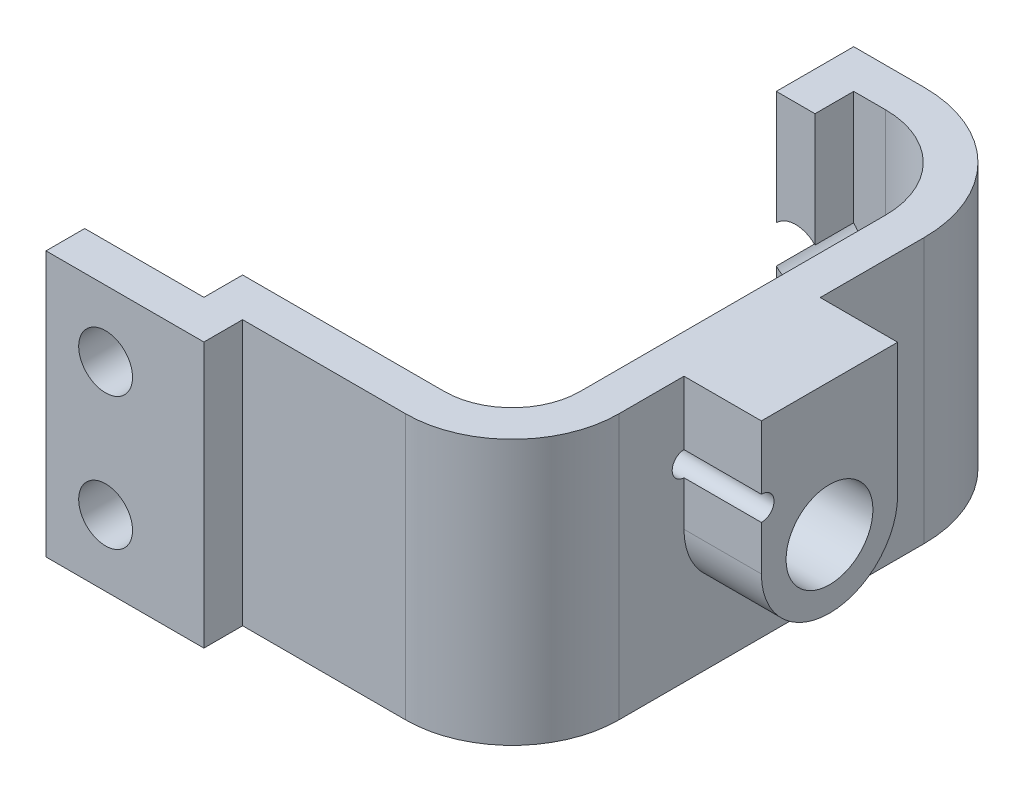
ISO-10303-21;
HEADER;
FILE_DESCRIPTION(('STEP AP214'),'2;1');
FILE_NAME('part.step','',(''),(''),'','','');
FILE_SCHEMA(('AUTOMOTIVE_DESIGN { 1 0 10303 214 1 1 1 1 }'));
ENDSEC;
DATA;
#1=APPLICATION_CONTEXT('core data for automotive mechanical design processes');
#2=APPLICATION_PROTOCOL_DEFINITION('international standard','automotive_design',2000,#1);
#3=PRODUCT_CONTEXT('',#1,'mechanical');
#4=PRODUCT('Part','Part','',(#3));
#5=PRODUCT_RELATED_PRODUCT_CATEGORY('part','',(#4));
#6=PRODUCT_DEFINITION_FORMATION('','',#4);
#7=PRODUCT_DEFINITION_CONTEXT('part definition',#1,'design');
#8=PRODUCT_DEFINITION('design','',#6,#7);
#9=PRODUCT_DEFINITION_SHAPE('','',#8);
#10=(LENGTH_UNIT() NAMED_UNIT(*) SI_UNIT(.MILLI.,.METRE.));
#11=(NAMED_UNIT(*) PLANE_ANGLE_UNIT() SI_UNIT($,.RADIAN.));
#12=(NAMED_UNIT(*) SI_UNIT($,.STERADIAN.) SOLID_ANGLE_UNIT());
#13=UNCERTAINTY_MEASURE_WITH_UNIT(LENGTH_MEASURE(1.E-05),#10,'distance_accuracy_value','');
#14=(GEOMETRIC_REPRESENTATION_CONTEXT(3) GLOBAL_UNCERTAINTY_ASSIGNED_CONTEXT((#13)) GLOBAL_UNIT_ASSIGNED_CONTEXT((#10,
#11,#12)) REPRESENTATION_CONTEXT('',''));
#15=CARTESIAN_POINT('',(0.,0.,0.));
#16=DIRECTION('',(0.,0.,1.));
#17=DIRECTION('',(1.,0.,0.));
#18=AXIS2_PLACEMENT_3D('',#15,#16,#17);
#19=CARTESIAN_POINT('',(15.4504200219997,21.75,-44.461807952));
#20=DIRECTION('',(1.,0.,0.));
#21=DIRECTION('',(0.,0.,-1.));
#22=AXIS2_PLACEMENT_3D('',#19,#20,#21);
#23=PLANE('',#22);
#24=DIRECTION('',(0.,-1.,0.));
#25=VECTOR('',#24,1.);
#26=CARTESIAN_POINT('',(15.4504200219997,21.75,-44.461807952));
#27=LINE('',#26,#25);
#28=CARTESIAN_POINT('',(15.4504200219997,21.75,-44.461807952));
#29=VERTEX_POINT('',#28);
#30=CARTESIAN_POINT('',(15.4504200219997,12.4122247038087,-44.4618079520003));
#31=VERTEX_POINT('',#30);
#32=EDGE_CURVE('E236',#29,#31,#27,.T.);
#33=ORIENTED_EDGE('',*,*,#32,.T.);
#34=DIRECTION('',(0.,0.,1.));
#35=VECTOR('',#34,1.);
#36=CARTESIAN_POINT('',(15.4504200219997,12.4122247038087,-44.4618079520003));
#37=LINE('',#36,#35);
#38=CARTESIAN_POINT('',(15.4504200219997,12.4122247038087,-38.111807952));
#39=VERTEX_POINT('',#38);
#40=EDGE_CURVE('E218',#31,#39,#37,.T.);
#41=ORIENTED_EDGE('',*,*,#40,.T.);
#42=DIRECTION('',(0.,-1.,0.));
#43=VECTOR('',#42,1.);
#44=CARTESIAN_POINT('',(15.4504200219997,21.75,-38.111807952));
#45=LINE('',#44,#43);
#46=CARTESIAN_POINT('',(15.4504200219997,21.75,-38.111807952));
#47=VERTEX_POINT('',#46);
#48=EDGE_CURVE('E247',#47,#39,#45,.T.);
#49=ORIENTED_EDGE('',*,*,#48,.F.);
#50=DIRECTION('',(0.,0.,1.));
#51=VECTOR('',#50,1.);
#52=CARTESIAN_POINT('',(15.4504200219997,21.75,-44.461807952));
#53=LINE('',#52,#51);
#54=EDGE_CURVE('E241',#29,#47,#53,.T.);
#55=ORIENTED_EDGE('',*,*,#54,.F.);
#56=EDGE_LOOP('',(#33,#41,#49,#55));
#57=FACE_BOUND('',#56,.T.);
#58=ADVANCED_FACE('F34',(#57),#23,.F.);
#59=CARTESIAN_POINT('',(15.4504200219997,21.75,-38.111807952));
#60=DIRECTION('',(0.,0.,-1.));
#61=DIRECTION('',(-1.,0.,0.));
#62=AXIS2_PLACEMENT_3D('',#59,#60,#61);
#63=PLANE('',#62);
#64=ORIENTED_EDGE('',*,*,#48,.T.);
#65=CARTESIAN_POINT('',(17.0379200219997,10.875,-38.111807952));
#66=DIRECTION('',(0.,0.,1.));
#67=DIRECTION('',(1.,0.,0.));
#68=AXIS2_PLACEMENT_3D('',#65,#66,#67);
#69=CIRCLE('',#68,2.2098);
#70=CARTESIAN_POINT('',(18.6254200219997,12.4122247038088,-38.111807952));
#71=VERTEX_POINT('',#70);
#72=EDGE_CURVE('E224',#71,#39,#69,.T.);
#73=ORIENTED_EDGE('',*,*,#72,.F.);
#74=DIRECTION('',(0.,-1.,0.));
#75=VECTOR('',#74,1.);
#76=CARTESIAN_POINT('',(18.6254200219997,21.75,-38.111807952));
#77=LINE('',#76,#75);
#78=CARTESIAN_POINT('',(18.6254200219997,21.75,-38.111807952));
#79=VERTEX_POINT('',#78);
#80=EDGE_CURVE('E354',#79,#71,#77,.T.);
#81=ORIENTED_EDGE('',*,*,#80,.F.);
#82=DIRECTION('',(1.,0.,0.));
#83=VECTOR('',#82,1.);
#84=CARTESIAN_POINT('',(15.4504200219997,21.75,-38.111807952));
#85=LINE('',#84,#83);
#86=EDGE_CURVE('E449',#47,#79,#85,.T.);
#87=ORIENTED_EDGE('',*,*,#86,.F.);
#88=EDGE_LOOP('',(#64,#73,#81,#87));
#89=FACE_BOUND('',#88,.T.);
#90=ADVANCED_FACE('F500',(#89),#63,.F.);
#91=CARTESIAN_POINT('',(18.6254200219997,21.75,-41.286807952));
#92=DIRECTION('',(1.,0.,0.));
#93=DIRECTION('',(0.,0.,-1.));
#94=AXIS2_PLACEMENT_3D('',#91,#92,#93);
#95=PLANE('',#94);
#96=DIRECTION('',(0.,0.,1.));
#97=VECTOR('',#96,1.);
#98=CARTESIAN_POINT('',(18.6254200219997,12.4122247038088,-44.4618079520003));
#99=LINE('',#98,#97);
#100=CARTESIAN_POINT('',(18.6254200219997,12.4122247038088,-41.286807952));
#101=VERTEX_POINT('',#100);
#102=EDGE_CURVE('E380',#101,#71,#99,.T.);
#103=ORIENTED_EDGE('',*,*,#102,.F.);
#104=DIRECTION('',(0.,-1.,0.));
#105=VECTOR('',#104,1.);
#106=CARTESIAN_POINT('',(18.6254200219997,21.75,-41.286807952));
#107=LINE('',#106,#105);
#108=CARTESIAN_POINT('',(18.6254200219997,21.75,-41.286807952));
#109=VERTEX_POINT('',#108);
#110=EDGE_CURVE('E351',#109,#101,#107,.T.);
#111=ORIENTED_EDGE('',*,*,#110,.F.);
#112=DIRECTION('',(0.,0.,1.));
#113=VECTOR('',#112,1.);
#114=CARTESIAN_POINT('',(18.6254200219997,21.75,-41.286807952));
#115=LINE('',#114,#113);
#116=EDGE_CURVE('E451',#109,#79,#115,.T.);
#117=ORIENTED_EDGE('',*,*,#116,.T.);
#118=ORIENTED_EDGE('',*,*,#80,.T.);
#119=EDGE_LOOP('',(#103,#111,#117,#118));
#120=FACE_BOUND('',#119,.T.);
#121=ADVANCED_FACE('F381',(#120),#95,.T.);
#122=CARTESIAN_POINT('',(-3.175,21.75,3.17500000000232));
#123=DIRECTION('',(0.,0.,-1.));
#124=DIRECTION('',(-1.,0.,0.));
#125=AXIS2_PLACEMENT_3D('',#122,#123,#124);
#126=PLANE('',#125);
#127=CARTESIAN_POINT('',(1.7145,16.3125,3.17500000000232));
#128=DIRECTION('',(0.,0.,-1.));
#129=DIRECTION('',(-1.,0.,0.));
#130=AXIS2_PLACEMENT_3D('',#127,#128,#129);
#131=CIRCLE('',#130,2.2098);
#132=CARTESIAN_POINT('',(-0.4953,16.3125,3.17500000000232));
#133=VERTEX_POINT('',#132);
#134=EDGE_CURVE('E507',#133,#133,#131,.T.);
#135=ORIENTED_EDGE('',*,*,#134,.T.);
#136=EDGE_LOOP('',(#135));
#137=FACE_BOUND('',#136,.T.);
#138=CARTESIAN_POINT('',(1.7145,5.4375,3.17500000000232));
#139=DIRECTION('',(0.,0.,-1.));
#140=DIRECTION('',(-1.,0.,0.));
#141=AXIS2_PLACEMENT_3D('',#138,#139,#140);
#142=CIRCLE('',#141,2.2098);
#143=CARTESIAN_POINT('',(-0.4953,5.4375,3.17500000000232));
#144=VERTEX_POINT('',#143);
#145=EDGE_CURVE('E502',#144,#144,#142,.T.);
#146=ORIENTED_EDGE('',*,*,#145,.T.);
#147=EDGE_LOOP('',(#146));
#148=FACE_BOUND('',#147,.T.);
#149=DIRECTION('',(1.,0.,0.));
#150=VECTOR('',#149,1.);
#151=CARTESIAN_POINT('',(-3.175,0.,3.17500000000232));
#152=LINE('',#151,#150);
#153=CARTESIAN_POINT('',(-3.175,0.,3.17500000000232));
#154=VERTEX_POINT('',#153);
#155=CARTESIAN_POINT('',(9.779,0.,3.17500000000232));
#156=VERTEX_POINT('',#155);
#157=EDGE_CURVE('E274',#154,#156,#152,.T.);
#158=ORIENTED_EDGE('',*,*,#157,.T.);
#159=DIRECTION('',(0.,-1.,0.));
#160=VECTOR('',#159,1.);
#161=CARTESIAN_POINT('',(9.779,21.75,3.17500000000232));
#162=LINE('',#161,#160);
#163=CARTESIAN_POINT('',(9.779,21.75,3.17500000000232));
#164=VERTEX_POINT('',#163);
#165=EDGE_CURVE('E42',#164,#156,#162,.T.);
#166=ORIENTED_EDGE('',*,*,#165,.F.);
#167=DIRECTION('',(1.,0.,0.));
#168=VECTOR('',#167,1.);
#169=CARTESIAN_POINT('',(-3.175,21.75,3.17500000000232));
#170=LINE('',#169,#168);
#171=CARTESIAN_POINT('',(-3.175,21.75,3.17500000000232));
#172=VERTEX_POINT('',#171);
#173=EDGE_CURVE('E332',#172,#164,#170,.T.);
#174=ORIENTED_EDGE('',*,*,#173,.F.);
#175=DIRECTION('',(0.,-1.,0.));
#176=VECTOR('',#175,1.);
#177=CARTESIAN_POINT('',(-3.175,21.75,3.17500000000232));
#178=LINE('',#177,#176);
#179=EDGE_CURVE('E276',#172,#154,#178,.T.);
#180=ORIENTED_EDGE('',*,*,#179,.T.);
#181=EDGE_LOOP('',(#158,#166,#174,#180));
#182=FACE_BOUND('',#181,.T.);
#183=ADVANCED_FACE('F36',(#137,#148,#182),#126,.F.);
#184=CARTESIAN_POINT('',(9.779,21.75,3.17500000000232));
#185=DIRECTION('',(-1.,0.,0.));
#186=DIRECTION('',(0.,0.,1.));
#187=AXIS2_PLACEMENT_3D('',#184,#185,#186);
#188=PLANE('',#187);
#189=DIRECTION('',(0.,0.,-1.));
#190=VECTOR('',#189,1.);
#191=CARTESIAN_POINT('',(9.779,0.,3.17500000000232));
#192=LINE('',#191,#190);
#193=CARTESIAN_POINT('',(9.779,0.,2.8796409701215E-13));
#194=VERTEX_POINT('',#193);
#195=EDGE_CURVE('E267',#156,#194,#192,.T.);
#196=ORIENTED_EDGE('',*,*,#195,.T.);
#197=DIRECTION('',(0.,-1.,0.));
#198=VECTOR('',#197,1.);
#199=CARTESIAN_POINT('',(9.779,21.75,2.8796409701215E-13));
#200=LINE('',#199,#198);
#201=CARTESIAN_POINT('',(9.779,21.75,2.8796409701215E-13));
#202=VERTEX_POINT('',#201);
#203=EDGE_CURVE('E259',#202,#194,#200,.T.);
#204=ORIENTED_EDGE('',*,*,#203,.F.);
#205=DIRECTION('',(0.,0.,-1.));
#206=VECTOR('',#205,1.);
#207=CARTESIAN_POINT('',(9.779,21.75,3.17500000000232));
#208=LINE('',#207,#206);
#209=EDGE_CURVE('E268',#164,#202,#208,.T.);
#210=ORIENTED_EDGE('',*,*,#209,.F.);
#211=ORIENTED_EDGE('',*,*,#165,.T.);
#212=EDGE_LOOP('',(#196,#204,#210,#211));
#213=FACE_BOUND('',#212,.T.);
#214=ADVANCED_FACE('F265',(#213),#188,.F.);
#215=CARTESIAN_POINT('',(9.779,21.75,2.8796409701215E-13));
#216=DIRECTION('',(0.,0.,-1.));
#217=DIRECTION('',(-1.,0.,0.));
#218=AXIS2_PLACEMENT_3D('',#215,#216,#217);
#219=PLANE('',#218);
#220=DIRECTION('',(1.,0.,0.));
#221=VECTOR('',#220,1.);
#222=CARTESIAN_POINT('',(9.779,0.,2.8796409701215E-13));
#223=LINE('',#222,#221);
#224=CARTESIAN_POINT('',(23.160491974,0.,4.31946145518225E-13));
#225=VERTEX_POINT('',#224);
#226=EDGE_CURVE('E281',#194,#225,#223,.T.);
#227=ORIENTED_EDGE('',*,*,#226,.T.);
#228=DIRECTION('',(0.,-1.,0.));
#229=VECTOR('',#228,1.);
#230=CARTESIAN_POINT('',(23.160491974,21.75,4.31946145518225E-13));
#231=LINE('',#230,#229);
#232=CARTESIAN_POINT('',(23.160491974,21.75,4.31946145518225E-13));
#233=VERTEX_POINT('',#232);
#234=EDGE_CURVE('E256',#233,#225,#231,.T.);
#235=ORIENTED_EDGE('',*,*,#234,.F.);
#236=DIRECTION('',(1.,0.,0.));
#237=VECTOR('',#236,1.);
#238=CARTESIAN_POINT('',(9.779,21.75,2.8796409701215E-13));
#239=LINE('',#238,#237);
#240=EDGE_CURVE('E436',#202,#233,#239,.T.);
#241=ORIENTED_EDGE('',*,*,#240,.F.);
#242=ORIENTED_EDGE('',*,*,#203,.T.);
#243=EDGE_LOOP('',(#227,#235,#241,#242));
#244=FACE_BOUND('',#243,.T.);
#245=ADVANCED_FACE('F575',(#244),#219,.F.);
#246=CARTESIAN_POINT('',(23.160491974,21.75,-8.73980802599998));
#247=DIRECTION('',(0.,-1.,0.));
#248=DIRECTION('',(0.,0.,-1.));
#249=AXIS2_PLACEMENT_3D('',#246,#247,#248);
#250=CYLINDRICAL_SURFACE('',#249,8.73980802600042);
#251=CARTESIAN_POINT('',(23.160491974,0.,-8.73980802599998));
#252=DIRECTION('',(0.,1.,0.));
#253=DIRECTION('',(0.,0.,1.));
#254=AXIS2_PLACEMENT_3D('',#251,#252,#253);
#255=CIRCLE('',#254,8.73980802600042);
#256=CARTESIAN_POINT('',(31.9003000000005,0.,-8.73980802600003));
#257=VERTEX_POINT('',#256);
#258=EDGE_CURVE('E291',#225,#257,#255,.T.);
#259=ORIENTED_EDGE('',*,*,#258,.T.);
#260=DIRECTION('',(0.,-1.,0.));
#261=VECTOR('',#260,1.);
#262=CARTESIAN_POINT('',(31.9003000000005,21.75,-8.73980802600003));
#263=LINE('',#262,#261);
#264=CARTESIAN_POINT('',(31.9003000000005,21.75,-8.73980802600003));
#265=VERTEX_POINT('',#264);
#266=EDGE_CURVE('E253',#265,#257,#263,.T.);
#267=ORIENTED_EDGE('',*,*,#266,.F.);
#268=CARTESIAN_POINT('',(23.160491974,21.75,-8.73980802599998));
#269=DIRECTION('',(0.,1.,0.));
#270=DIRECTION('',(0.,0.,1.));
#271=AXIS2_PLACEMENT_3D('',#268,#269,#270);
#272=CIRCLE('',#271,8.73980802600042);
#273=EDGE_CURVE('E438',#233,#265,#272,.T.);
#274=ORIENTED_EDGE('',*,*,#273,.F.);
#275=ORIENTED_EDGE('',*,*,#234,.T.);
#276=EDGE_LOOP('',(#259,#267,#274,#275));
#277=FACE_BOUND('',#276,.T.);
#278=ADVANCED_FACE('F571',(#277),#250,.T.);
#279=CARTESIAN_POINT('',(31.9003000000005,21.75,-8.73980802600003));
#280=DIRECTION('',(-1.,0.,0.));
#281=DIRECTION('',(0.,0.,1.));
#282=AXIS2_PLACEMENT_3D('',#279,#280,#281);
#283=PLANE('',#282);
#284=DIRECTION('',(0.,-1.,0.));
#285=VECTOR('',#284,1.);
#286=CARTESIAN_POINT('',(31.9003000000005,16.5346239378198,-14.088314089));
#287=LINE('',#286,#285);
#288=CARTESIAN_POINT('',(31.9003000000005,21.75,-14.088314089));
#289=VERTEX_POINT('',#288);
#290=CARTESIAN_POINT('',(31.9003000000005,16.5346239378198,-14.088314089));
#291=VERTEX_POINT('',#290);
#292=EDGE_CURVE('E412',#289,#291,#287,.T.);
#293=ORIENTED_EDGE('',*,*,#292,.F.);
#294=DIRECTION('',(0.,0.,-1.));
#295=VECTOR('',#294,1.);
#296=CARTESIAN_POINT('',(31.9003000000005,21.75,-8.73980802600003));
#297=LINE('',#296,#295);
#298=EDGE_CURVE('E441',#265,#289,#297,.T.);
#299=ORIENTED_EDGE('',*,*,#298,.F.);
#300=ORIENTED_EDGE('',*,*,#266,.T.);
#301=DIRECTION('',(0.,0.,-1.));
#302=VECTOR('',#301,1.);
#303=CARTESIAN_POINT('',(31.9003000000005,0.,-8.73980802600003));
#304=LINE('',#303,#302);
#305=CARTESIAN_POINT('',(31.9003000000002,0.,-33.787820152));
#306=VERTEX_POINT('',#305);
#307=EDGE_CURVE('E293',#257,#306,#304,.T.);
#308=ORIENTED_EDGE('',*,*,#307,.T.);
#309=DIRECTION('',(0.,-1.,0.));
#310=VECTOR('',#309,1.);
#311=CARTESIAN_POINT('',(31.9003000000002,21.75,-33.787820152));
#312=LINE('',#311,#310);
#313=CARTESIAN_POINT('',(31.9003000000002,21.75,-33.787820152));
#314=VERTEX_POINT('',#313);
#315=EDGE_CURVE('E245',#314,#306,#312,.T.);
#316=ORIENTED_EDGE('',*,*,#315,.F.);
#317=CARTESIAN_POINT('',(31.9003000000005,21.75,-25.264314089));
#318=VERTEX_POINT('',#317);
#319=EDGE_CURVE('E440',#318,#314,#297,.T.);
#320=ORIENTED_EDGE('',*,*,#319,.F.);
#321=DIRECTION('',(0.,1.,0.));
#322=VECTOR('',#321,1.);
#323=CARTESIAN_POINT('',(31.9003000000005,10.875,-25.264314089));
#324=LINE('',#323,#322);
#325=CARTESIAN_POINT('',(31.9003000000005,10.875,-25.264314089));
#326=VERTEX_POINT('',#325);
#327=EDGE_CURVE('E410',#326,#318,#324,.T.);
#328=ORIENTED_EDGE('',*,*,#327,.F.);
#329=CARTESIAN_POINT('',(31.9003000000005,10.875,-19.676314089));
#330=DIRECTION('',(1.,0.,0.));
#331=DIRECTION('',(0.,0.,-1.));
#332=AXIS2_PLACEMENT_3D('',#329,#330,#331);
#333=CIRCLE('',#332,5.588);
#334=CARTESIAN_POINT('',(31.9003000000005,10.875,-14.088314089));
#335=VERTEX_POINT('',#334);
#336=EDGE_CURVE('E392',#335,#326,#333,.T.);
#337=ORIENTED_EDGE('',*,*,#336,.F.);
#338=DIRECTION('',(0.,-1.,0.));
#339=VECTOR('',#338,1.);
#340=CARTESIAN_POINT('',(31.9003000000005,10.875,-14.088314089));
#341=LINE('',#340,#339);
#342=CARTESIAN_POINT('',(31.9003000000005,14.535796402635,-14.088314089));
#343=VERTEX_POINT('',#342);
#344=EDGE_CURVE('E397',#343,#335,#341,.T.);
#345=ORIENTED_EDGE('',*,*,#344,.F.);
#346=CARTESIAN_POINT('',(31.9003000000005,15.5352101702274,-14.1224918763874));
#347=DIRECTION('',(1.,0.,0.));
#348=DIRECTION('',(0.,0.,-1.));
#349=AXIS2_PLACEMENT_3D('',#346,#347,#348);
#350=CIRCLE('',#349,0.999997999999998);
#351=EDGE_CURVE('E428',#291,#343,#350,.T.);
#352=ORIENTED_EDGE('',*,*,#351,.F.);
#353=EDGE_LOOP('',(#293,#299,#300,#308,#316,#320,#328,#337,#345,#352));
#354=FACE_BOUND('',#353,.T.);
#355=CARTESIAN_POINT('',(31.9003000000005,6.2147898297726,-25.2301363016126));
#356=DIRECTION('',(1.,0.,0.));
#357=DIRECTION('',(0.,0.,-1.));
#358=AXIS2_PLACEMENT_3D('',#355,#356,#357);
#359=CIRCLE('',#358,0.999997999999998);
#360=CARTESIAN_POINT('',(31.9003000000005,6.2147898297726,-26.2301343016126));
#361=VERTEX_POINT('',#360);
#362=EDGE_CURVE('E279',#361,#361,#359,.T.);
#363=ORIENTED_EDGE('',*,*,#362,.F.);
#364=EDGE_LOOP('',(#363));
#365=FACE_BOUND('',#364,.T.);
#366=ADVANCED_FACE('F564',(#354,#365),#283,.F.);
#367=CARTESIAN_POINT('',(21.2263122,21.75,-33.787820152));
#368=DIRECTION('',(0.,-1.,0.));
#369=DIRECTION('',(0.,0.,-1.));
#370=AXIS2_PLACEMENT_3D('',#367,#368,#369);
#371=CYLINDRICAL_SURFACE('',#370,10.6739878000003);
#372=CARTESIAN_POINT('',(21.2263122,0.,-33.787820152));
#373=DIRECTION('',(0.,1.,0.));
#374=DIRECTION('',(0.,0.,1.));
#375=AXIS2_PLACEMENT_3D('',#372,#373,#374);
#376=CIRCLE('',#375,10.6739878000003);
#377=CARTESIAN_POINT('',(21.2263122,0.,-44.461807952));
#378=VERTEX_POINT('',#377);
#379=EDGE_CURVE('E295',#306,#378,#376,.T.);
#380=ORIENTED_EDGE('',*,*,#379,.T.);
#381=DIRECTION('',(0.,-1.,0.));
#382=VECTOR('',#381,1.);
#383=CARTESIAN_POINT('',(21.2263122,21.75,-44.461807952));
#384=LINE('',#383,#382);
#385=CARTESIAN_POINT('',(21.2263122,21.75,-44.461807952));
#386=VERTEX_POINT('',#385);
#387=EDGE_CURVE('E243',#386,#378,#384,.T.);
#388=ORIENTED_EDGE('',*,*,#387,.F.);
#389=CARTESIAN_POINT('',(21.2263122,21.75,-33.787820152));
#390=DIRECTION('',(0.,1.,0.));
#391=DIRECTION('',(0.,0.,1.));
#392=AXIS2_PLACEMENT_3D('',#389,#390,#391);
#393=CIRCLE('',#392,10.6739878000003);
#394=EDGE_CURVE('E444',#314,#386,#393,.T.);
#395=ORIENTED_EDGE('',*,*,#394,.F.);
#396=ORIENTED_EDGE('',*,*,#315,.T.);
#397=EDGE_LOOP('',(#380,#388,#395,#396));
#398=FACE_BOUND('',#397,.T.);
#399=ADVANCED_FACE('F553',(#398),#371,.T.);
#400=CARTESIAN_POINT('',(15.4504200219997,21.75,-44.461807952));
#401=DIRECTION('',(0.,0.,-1.));
#402=DIRECTION('',(-1.,0.,0.));
#403=AXIS2_PLACEMENT_3D('',#400,#401,#402);
#404=PLANE('',#403);
#405=CARTESIAN_POINT('',(17.0379200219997,10.875,-44.4618079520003));
#406=DIRECTION('',(0.,0.,1.));
#407=DIRECTION('',(1.,0.,0.));
#408=AXIS2_PLACEMENT_3D('',#405,#406,#407);
#409=CIRCLE('',#408,2.2098);
#410=CARTESIAN_POINT('',(15.4504200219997,9.33777529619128,-44.4618079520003));
#411=VERTEX_POINT('',#410);
#412=EDGE_CURVE('E221',#411,#31,#409,.T.);
#413=ORIENTED_EDGE('',*,*,#412,.T.);
#414=ORIENTED_EDGE('',*,*,#32,.F.);
#415=DIRECTION('',(1.,0.,0.));
#416=VECTOR('',#415,1.);
#417=CARTESIAN_POINT('',(15.4504200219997,21.75,-44.461807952));
#418=LINE('',#417,#416);
#419=EDGE_CURVE('E446',#29,#386,#418,.T.);
#420=ORIENTED_EDGE('',*,*,#419,.T.);
#421=ORIENTED_EDGE('',*,*,#387,.T.);
#422=DIRECTION('',(1.,0.,0.));
#423=VECTOR('',#422,1.);
#424=CARTESIAN_POINT('',(15.4504200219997,0.,-44.461807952));
#425=LINE('',#424,#423);
#426=CARTESIAN_POINT('',(15.4504200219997,0.,-44.461807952));
#427=VERTEX_POINT('',#426);
#428=EDGE_CURVE('E298',#427,#378,#425,.T.);
#429=ORIENTED_EDGE('',*,*,#428,.F.);
#430=EDGE_CURVE('E239',#411,#427,#27,.T.);
#431=ORIENTED_EDGE('',*,*,#430,.F.);
#432=EDGE_LOOP('',(#413,#414,#420,#421,#429,#431));
#433=FACE_BOUND('',#432,.T.);
#434=ADVANCED_FACE('F234',(#433),#404,.T.);
#435=CARTESIAN_POINT('',(15.4504200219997,9.33777529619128,-38.111807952));
#436=VERTEX_POINT('',#435);
#437=CARTESIAN_POINT('',(15.4504200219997,0.,-38.111807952));
#438=VERTEX_POINT('',#437);
#439=EDGE_CURVE('E356',#436,#438,#45,.T.);
#440=ORIENTED_EDGE('',*,*,#439,.F.);
#441=DIRECTION('',(0.,0.,1.));
#442=VECTOR('',#441,1.);
#443=CARTESIAN_POINT('',(15.4504200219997,9.33777529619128,-44.4618079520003));
#444=LINE('',#443,#442);
#445=EDGE_CURVE('E230',#436,#411,#444,.F.);
#446=ORIENTED_EDGE('',*,*,#445,.T.);
#447=ORIENTED_EDGE('',*,*,#430,.T.);
#448=DIRECTION('',(0.,0.,1.));
#449=VECTOR('',#448,1.);
#450=CARTESIAN_POINT('',(15.4504200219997,0.,-44.461807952));
#451=LINE('',#450,#449);
#452=EDGE_CURVE('E301',#427,#438,#451,.T.);
#453=ORIENTED_EDGE('',*,*,#452,.T.);
#454=EDGE_LOOP('',(#440,#446,#447,#453));
#455=FACE_BOUND('',#454,.T.);
#456=ADVANCED_FACE('F541',(#455),#23,.F.);
#457=CARTESIAN_POINT('',(18.6254200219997,9.33777529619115,-38.111807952));
#458=VERTEX_POINT('',#457);
#459=CARTESIAN_POINT('',(18.6254200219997,0.,-38.111807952));
#460=VERTEX_POINT('',#459);
#461=EDGE_CURVE('E353',#458,#460,#77,.T.);
#462=ORIENTED_EDGE('',*,*,#461,.F.);
#463=EDGE_CURVE('E501',#436,#458,#69,.T.);
#464=ORIENTED_EDGE('',*,*,#463,.F.);
#465=ORIENTED_EDGE('',*,*,#439,.T.);
#466=DIRECTION('',(1.,0.,0.));
#467=VECTOR('',#466,1.);
#468=CARTESIAN_POINT('',(15.4504200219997,0.,-38.111807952));
#469=LINE('',#468,#467);
#470=EDGE_CURVE('E304',#438,#460,#469,.T.);
#471=ORIENTED_EDGE('',*,*,#470,.T.);
#472=EDGE_LOOP('',(#462,#464,#465,#471));
#473=FACE_BOUND('',#472,.T.);
#474=ADVANCED_FACE('F369',(#473),#63,.F.);
#475=DIRECTION('',(0.,0.,1.));
#476=VECTOR('',#475,1.);
#477=CARTESIAN_POINT('',(18.6254200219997,9.33777529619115,-44.4618079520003));
#478=LINE('',#477,#476);
#479=CARTESIAN_POINT('',(18.6254200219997,9.33777529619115,-41.286807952));
#480=VERTEX_POINT('',#479);
#481=EDGE_CURVE('E49',#458,#480,#478,.F.);
#482=ORIENTED_EDGE('',*,*,#481,.F.);
#483=ORIENTED_EDGE('',*,*,#461,.T.);
#484=DIRECTION('',(0.,0.,1.));
#485=VECTOR('',#484,1.);
#486=CARTESIAN_POINT('',(18.6254200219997,0.,-41.286807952));
#487=LINE('',#486,#485);
#488=CARTESIAN_POINT('',(18.6254200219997,0.,-41.286807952));
#489=VERTEX_POINT('',#488);
#490=EDGE_CURVE('E307',#489,#460,#487,.T.);
#491=ORIENTED_EDGE('',*,*,#490,.F.);
#492=EDGE_CURVE('E350',#480,#489,#107,.T.);
#493=ORIENTED_EDGE('',*,*,#492,.F.);
#494=EDGE_LOOP('',(#482,#483,#491,#493));
#495=FACE_BOUND('',#494,.T.);
#496=ADVANCED_FACE('F364',(#495),#95,.T.);
#497=CARTESIAN_POINT('',(18.6254200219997,21.75,-41.286807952));
#498=DIRECTION('',(0.,0.,-1.));
#499=DIRECTION('',(-1.,0.,0.));
#500=AXIS2_PLACEMENT_3D('',#497,#498,#499);
#501=PLANE('',#500);
#502=ORIENTED_EDGE('',*,*,#110,.T.);
#503=CARTESIAN_POINT('',(17.0379200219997,10.875,-41.286807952));
#504=DIRECTION('',(0.,0.,-1.));
#505=DIRECTION('',(-1.,0.,0.));
#506=AXIS2_PLACEMENT_3D('',#503,#504,#505);
#507=CIRCLE('',#506,2.2098);
#508=EDGE_CURVE('E11',#101,#480,#507,.T.);
#509=ORIENTED_EDGE('',*,*,#508,.T.);
#510=ORIENTED_EDGE('',*,*,#492,.T.);
#511=DIRECTION('',(1.,0.,0.));
#512=VECTOR('',#511,1.);
#513=CARTESIAN_POINT('',(18.6254200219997,0.,-41.286807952));
#514=LINE('',#513,#512);
#515=CARTESIAN_POINT('',(21.2263122,0.,-41.2868079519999));
#516=VERTEX_POINT('',#515);
#517=EDGE_CURVE('E310',#489,#516,#514,.T.);
#518=ORIENTED_EDGE('',*,*,#517,.T.);
#519=DIRECTION('',(0.,-1.,0.));
#520=VECTOR('',#519,1.);
#521=CARTESIAN_POINT('',(21.2263122,21.75,-41.2868079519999));
#522=LINE('',#521,#520);
#523=CARTESIAN_POINT('',(21.2263122,21.75,-41.2868079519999));
#524=VERTEX_POINT('',#523);
#525=EDGE_CURVE('E348',#524,#516,#522,.T.);
#526=ORIENTED_EDGE('',*,*,#525,.F.);
#527=DIRECTION('',(1.,0.,0.));
#528=VECTOR('',#527,1.);
#529=CARTESIAN_POINT('',(18.6254200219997,21.75,-41.286807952));
#530=LINE('',#529,#528);
#531=EDGE_CURVE('E453',#109,#524,#530,.T.);
#532=ORIENTED_EDGE('',*,*,#531,.F.);
#533=EDGE_LOOP('',(#502,#509,#510,#518,#526,#532));
#534=FACE_BOUND('',#533,.T.);
#535=ADVANCED_FACE('F377',(#534),#501,.F.);
#536=CARTESIAN_POINT('',(21.2263122,21.75,-33.787820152));
#537=DIRECTION('',(0.,-1.,0.));
#538=DIRECTION('',(0.,0.,-1.));
#539=AXIS2_PLACEMENT_3D('',#536,#537,#538);
#540=CYLINDRICAL_SURFACE('',#539,7.49898779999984);
#541=CARTESIAN_POINT('',(21.2263122,0.,-33.787820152));
#542=DIRECTION('',(0.,1.,0.));
#543=DIRECTION('',(0.,0.,1.));
#544=AXIS2_PLACEMENT_3D('',#541,#542,#543);
#545=CIRCLE('',#544,7.49898779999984);
#546=CARTESIAN_POINT('',(28.7252999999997,0.,-33.787820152));
#547=VERTEX_POINT('',#546);
#548=EDGE_CURVE('E313',#547,#516,#545,.T.);
#549=ORIENTED_EDGE('',*,*,#548,.F.);
#550=DIRECTION('',(0.,-1.,0.));
#551=VECTOR('',#550,1.);
#552=CARTESIAN_POINT('',(28.7252999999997,21.75,-33.787820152));
#553=LINE('',#552,#551);
#554=CARTESIAN_POINT('',(28.7252999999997,21.75,-33.787820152));
#555=VERTEX_POINT('',#554);
#556=EDGE_CURVE('E346',#555,#547,#553,.T.);
#557=ORIENTED_EDGE('',*,*,#556,.F.);
#558=CARTESIAN_POINT('',(21.2263122,21.75,-33.787820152));
#559=DIRECTION('',(0.,1.,0.));
#560=DIRECTION('',(0.,0.,1.));
#561=AXIS2_PLACEMENT_3D('',#558,#559,#560);
#562=CIRCLE('',#561,7.49898779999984);
#563=EDGE_CURVE('E455',#555,#524,#562,.T.);
#564=ORIENTED_EDGE('',*,*,#563,.T.);
#565=ORIENTED_EDGE('',*,*,#525,.T.);
#566=EDGE_LOOP('',(#549,#557,#564,#565));
#567=FACE_BOUND('',#566,.T.);
#568=ADVANCED_FACE('F496',(#567),#540,.F.);
#569=CARTESIAN_POINT('',(28.7252999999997,21.75,-8.73980802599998));
#570=DIRECTION('',(-1.,0.,0.));
#571=DIRECTION('',(0.,0.,1.));
#572=AXIS2_PLACEMENT_3D('',#569,#570,#571);
#573=PLANE('',#572);
#574=CARTESIAN_POINT('',(28.7252999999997,10.875,-19.676314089));
#575=DIRECTION('',(-1.,0.,0.));
#576=DIRECTION('',(0.,0.,1.));
#577=AXIS2_PLACEMENT_3D('',#574,#575,#576);
#578=CIRCLE('',#577,3.5625);
#579=CARTESIAN_POINT('',(28.7252999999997,10.875,-16.113814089));
#580=VERTEX_POINT('',#579);
#581=EDGE_CURVE('E229',#580,#580,#578,.F.);
#582=ORIENTED_EDGE('',*,*,#581,.T.);
#583=EDGE_LOOP('',(#582));
#584=FACE_BOUND('',#583,.T.);
#585=CARTESIAN_POINT('',(28.7252999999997,15.5352101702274,-14.1224918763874));
#586=DIRECTION('',(-1.,0.,0.));
#587=DIRECTION('',(0.,0.,1.));
#588=AXIS2_PLACEMENT_3D('',#585,#586,#587);
#589=CIRCLE('',#588,0.999997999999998);
#590=CARTESIAN_POINT('',(28.7252999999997,15.5352101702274,-13.1224938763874));
#591=VERTEX_POINT('',#590);
#592=EDGE_CURVE('E427',#591,#591,#589,.F.);
#593=ORIENTED_EDGE('',*,*,#592,.T.);
#594=EDGE_LOOP('',(#593));
#595=FACE_BOUND('',#594,.T.);
#596=CARTESIAN_POINT('',(28.7252999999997,6.2147898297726,-25.2301363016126));
#597=DIRECTION('',(-1.,0.,0.));
#598=DIRECTION('',(0.,0.,1.));
#599=AXIS2_PLACEMENT_3D('',#596,#597,#598);
#600=CIRCLE('',#599,0.999997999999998);
#601=CARTESIAN_POINT('',(28.7252999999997,6.2147898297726,-24.2301383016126));
#602=VERTEX_POINT('',#601);
#603=EDGE_CURVE('E284',#602,#602,#600,.F.);
#604=ORIENTED_EDGE('',*,*,#603,.T.);
#605=EDGE_LOOP('',(#604));
#606=FACE_BOUND('',#605,.T.);
#607=DIRECTION('',(0.,0.,-1.));
#608=VECTOR('',#607,1.);
#609=CARTESIAN_POINT('',(28.7252999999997,0.,-8.73980802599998));
#610=LINE('',#609,#608);
#611=CARTESIAN_POINT('',(28.7253000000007,0.,-8.73980802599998));
#612=VERTEX_POINT('',#611);
#613=EDGE_CURVE('E316',#612,#547,#610,.T.);
#614=ORIENTED_EDGE('',*,*,#613,.F.);
#615=DIRECTION('',(0.,-1.,0.));
#616=VECTOR('',#615,1.);
#617=CARTESIAN_POINT('',(28.7253000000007,21.75,-8.73980802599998));
#618=LINE('',#617,#616);
#619=CARTESIAN_POINT('',(28.7253000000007,21.75,-8.73980802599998));
#620=VERTEX_POINT('',#619);
#621=EDGE_CURVE('E344',#620,#612,#618,.T.);
#622=ORIENTED_EDGE('',*,*,#621,.F.);
#623=DIRECTION('',(0.,0.,-1.));
#624=VECTOR('',#623,1.);
#625=CARTESIAN_POINT('',(28.7252999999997,21.75,-8.73980802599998));
#626=LINE('',#625,#624);
#627=EDGE_CURVE('E457',#620,#555,#626,.T.);
#628=ORIENTED_EDGE('',*,*,#627,.T.);
#629=ORIENTED_EDGE('',*,*,#556,.T.);
#630=EDGE_LOOP('',(#614,#622,#628,#629));
#631=FACE_BOUND('',#630,.T.);
#632=ADVANCED_FACE('F493',(#584,#595,#606,#631),#573,.T.);
#633=CARTESIAN_POINT('',(23.160491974,21.75,-8.73980802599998));
#634=DIRECTION('',(0.,-1.,0.));
#635=DIRECTION('',(0.,0.,-1.));
#636=AXIS2_PLACEMENT_3D('',#633,#634,#635);
#637=CYLINDRICAL_SURFACE('',#636,5.56480802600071);
#638=CARTESIAN_POINT('',(23.160491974,0.,-8.73980802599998));
#639=DIRECTION('',(0.,1.,0.));
#640=DIRECTION('',(0.,0.,1.));
#641=AXIS2_PLACEMENT_3D('',#638,#639,#640);
#642=CIRCLE('',#641,5.56480802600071);
#643=CARTESIAN_POINT('',(23.160491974,0.,-3.17499999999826));
#644=VERTEX_POINT('',#643);
#645=EDGE_CURVE('E319',#644,#612,#642,.T.);
#646=ORIENTED_EDGE('',*,*,#645,.F.);
#647=DIRECTION('',(0.,-1.,0.));
#648=VECTOR('',#647,1.);
#649=CARTESIAN_POINT('',(23.160491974,21.75,-3.17499999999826));
#650=LINE('',#649,#648);
#651=CARTESIAN_POINT('',(23.160491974,21.75,-3.17499999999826));
#652=VERTEX_POINT('',#651);
#653=EDGE_CURVE('E342',#652,#644,#650,.T.);
#654=ORIENTED_EDGE('',*,*,#653,.F.);
#655=CARTESIAN_POINT('',(23.160491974,21.75,-8.73980802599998));
#656=DIRECTION('',(0.,1.,0.));
#657=DIRECTION('',(0.,0.,1.));
#658=AXIS2_PLACEMENT_3D('',#655,#656,#657);
#659=CIRCLE('',#658,5.56480802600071);
#660=EDGE_CURVE('E460',#652,#620,#659,.T.);
#661=ORIENTED_EDGE('',*,*,#660,.T.);
#662=ORIENTED_EDGE('',*,*,#621,.T.);
#663=EDGE_LOOP('',(#646,#654,#661,#662));
#664=FACE_BOUND('',#663,.T.);
#665=ADVANCED_FACE('F489',(#664),#637,.F.);
#666=CARTESIAN_POINT('',(6.604,21.75,-3.17499999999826));
#667=DIRECTION('',(0.,0.,-1.));
#668=DIRECTION('',(-1.,0.,0.));
#669=AXIS2_PLACEMENT_3D('',#666,#667,#668);
#670=PLANE('',#669);
#671=DIRECTION('',(1.,0.,0.));
#672=VECTOR('',#671,1.);
#673=CARTESIAN_POINT('',(6.604,0.,-3.17499999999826));
#674=LINE('',#673,#672);
#675=CARTESIAN_POINT('',(6.604,0.,-3.17499999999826));
#676=VERTEX_POINT('',#675);
#677=EDGE_CURVE('E322',#676,#644,#674,.T.);
#678=ORIENTED_EDGE('',*,*,#677,.F.);
#679=DIRECTION('',(0.,-1.,0.));
#680=VECTOR('',#679,1.);
#681=CARTESIAN_POINT('',(6.604,21.75,-3.17499999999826));
#682=LINE('',#681,#680);
#683=CARTESIAN_POINT('',(6.604,21.75,-3.17499999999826));
#684=VERTEX_POINT('',#683);
#685=EDGE_CURVE('E340',#684,#676,#682,.T.);
#686=ORIENTED_EDGE('',*,*,#685,.F.);
#687=DIRECTION('',(1.,0.,0.));
#688=VECTOR('',#687,1.);
#689=CARTESIAN_POINT('',(6.604,21.75,-3.17499999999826));
#690=LINE('',#689,#688);
#691=EDGE_CURVE('E463',#684,#652,#690,.T.);
#692=ORIENTED_EDGE('',*,*,#691,.T.);
#693=ORIENTED_EDGE('',*,*,#653,.T.);
#694=EDGE_LOOP('',(#678,#686,#692,#693));
#695=FACE_BOUND('',#694,.T.);
#696=ADVANCED_FACE('F485',(#695),#670,.T.);
#697=CARTESIAN_POINT('',(6.604,21.75,-3.17499999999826));
#698=DIRECTION('',(1.,0.,0.));
#699=DIRECTION('',(0.,0.,-1.));
#700=AXIS2_PLACEMENT_3D('',#697,#698,#699);
#701=PLANE('',#700);
#702=DIRECTION('',(0.,0.,1.));
#703=VECTOR('',#702,1.);
#704=CARTESIAN_POINT('',(6.604,0.,-3.17499999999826));
#705=LINE('',#704,#703);
#706=CARTESIAN_POINT('',(6.604,0.,0.));
#707=VERTEX_POINT('',#706);
#708=EDGE_CURVE('E325',#676,#707,#705,.T.);
#709=ORIENTED_EDGE('',*,*,#708,.T.);
#710=DIRECTION('',(0.,-1.,0.));
#711=VECTOR('',#710,1.);
#712=CARTESIAN_POINT('',(6.604,21.75,0.));
#713=LINE('',#712,#711);
#714=CARTESIAN_POINT('',(6.604,21.75,0.));
#715=VERTEX_POINT('',#714);
#716=EDGE_CURVE('E337',#715,#707,#713,.T.);
#717=ORIENTED_EDGE('',*,*,#716,.F.);
#718=DIRECTION('',(0.,0.,1.));
#719=VECTOR('',#718,1.);
#720=CARTESIAN_POINT('',(6.604,21.75,-3.17499999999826));
#721=LINE('',#720,#719);
#722=EDGE_CURVE('E466',#684,#715,#721,.T.);
#723=ORIENTED_EDGE('',*,*,#722,.F.);
#724=ORIENTED_EDGE('',*,*,#685,.T.);
#725=EDGE_LOOP('',(#709,#717,#723,#724));
#726=FACE_BOUND('',#725,.T.);
#727=ADVANCED_FACE('F482',(#726),#701,.F.);
#728=CARTESIAN_POINT('',(0.,21.75,0.));
#729=DIRECTION('',(0.,0.,1.));
#730=DIRECTION('',(1.,0.,0.));
#731=AXIS2_PLACEMENT_3D('',#728,#729,#730);
#732=PLANE('',#731);
#733=CARTESIAN_POINT('',(1.7145,16.3125,0.));
#734=DIRECTION('',(0.,0.,-1.));
#735=DIRECTION('',(-1.,0.,0.));
#736=AXIS2_PLACEMENT_3D('',#733,#734,#735);
#737=CIRCLE('',#736,2.2098);
#738=CARTESIAN_POINT('',(-0.495300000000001,16.3125,0.));
#739=VERTEX_POINT('',#738);
#740=EDGE_CURVE('E510',#739,#739,#737,.T.);
#741=ORIENTED_EDGE('',*,*,#740,.F.);
#742=EDGE_LOOP('',(#741));
#743=FACE_BOUND('',#742,.T.);
#744=CARTESIAN_POINT('',(1.7145,5.4375,0.));
#745=DIRECTION('',(0.,0.,-1.));
#746=DIRECTION('',(-1.,0.,0.));
#747=AXIS2_PLACEMENT_3D('',#744,#745,#746);
#748=CIRCLE('',#747,2.2098);
#749=CARTESIAN_POINT('',(-0.495300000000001,5.4375,0.));
#750=VERTEX_POINT('',#749);
#751=EDGE_CURVE('E504',#750,#750,#748,.T.);
#752=ORIENTED_EDGE('',*,*,#751,.F.);
#753=EDGE_LOOP('',(#752));
#754=FACE_BOUND('',#753,.T.);
#755=DIRECTION('',(-1.,0.,0.));
#756=VECTOR('',#755,1.);
#757=CARTESIAN_POINT('',(0.,0.,0.));
#758=LINE('',#757,#756);
#759=CARTESIAN_POINT('',(-3.175,0.,0.));
#760=VERTEX_POINT('',#759);
#761=EDGE_CURVE('E328',#707,#760,#758,.T.);
#762=ORIENTED_EDGE('',*,*,#761,.T.);
#763=DIRECTION('',(0.,-1.,0.));
#764=VECTOR('',#763,1.);
#765=CARTESIAN_POINT('',(-3.175,21.75,0.));
#766=LINE('',#765,#764);
#767=CARTESIAN_POINT('',(-3.175,21.75,0.));
#768=VERTEX_POINT('',#767);
#769=EDGE_CURVE('E334',#768,#760,#766,.T.);
#770=ORIENTED_EDGE('',*,*,#769,.F.);
#771=DIRECTION('',(1.,0.,0.));
#772=VECTOR('',#771,1.);
#773=CARTESIAN_POINT('',(0.,21.75,0.));
#774=LINE('',#773,#772);
#775=EDGE_CURVE('E467',#768,#715,#774,.T.);
#776=ORIENTED_EDGE('',*,*,#775,.T.);
#777=ORIENTED_EDGE('',*,*,#716,.T.);
#778=EDGE_LOOP('',(#762,#770,#776,#777));
#779=FACE_BOUND('',#778,.T.);
#780=ADVANCED_FACE('F479',(#743,#754,#779),#732,.F.);
#781=CARTESIAN_POINT('',(-3.175,21.75,0.));
#782=DIRECTION('',(1.,0.,0.));
#783=DIRECTION('',(0.,0.,-1.));
#784=AXIS2_PLACEMENT_3D('',#781,#782,#783);
#785=PLANE('',#784);
#786=DIRECTION('',(0.,0.,1.));
#787=VECTOR('',#786,1.);
#788=CARTESIAN_POINT('',(-3.175,0.,0.));
#789=LINE('',#788,#787);
#790=EDGE_CURVE('E330',#760,#154,#789,.T.);
#791=ORIENTED_EDGE('',*,*,#790,.T.);
#792=ORIENTED_EDGE('',*,*,#179,.F.);
#793=DIRECTION('',(0.,0.,1.));
#794=VECTOR('',#793,1.);
#795=CARTESIAN_POINT('',(-3.175,21.75,0.));
#796=LINE('',#795,#794);
#797=EDGE_CURVE('E287',#768,#172,#796,.T.);
#798=ORIENTED_EDGE('',*,*,#797,.F.);
#799=ORIENTED_EDGE('',*,*,#769,.T.);
#800=EDGE_LOOP('',(#791,#792,#798,#799));
#801=FACE_BOUND('',#800,.T.);
#802=ADVANCED_FACE('F475',(#801),#785,.F.);
#803=CARTESIAN_POINT('',(23.160491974,21.75,-8.73980802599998));
#804=DIRECTION('',(0.,1.,0.));
#805=DIRECTION('',(0.,0.,1.));
#806=AXIS2_PLACEMENT_3D('',#803,#804,#805);
#807=PLANE('',#806);
#808=ORIENTED_EDGE('',*,*,#173,.T.);
#809=ORIENTED_EDGE('',*,*,#209,.T.);
#810=ORIENTED_EDGE('',*,*,#240,.T.);
#811=ORIENTED_EDGE('',*,*,#273,.T.);
#812=ORIENTED_EDGE('',*,*,#298,.T.);
#813=DIRECTION('',(-1.,0.,0.));
#814=VECTOR('',#813,1.);
#815=CARTESIAN_POINT('',(38.2503000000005,21.75,-14.088314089));
#816=LINE('',#815,#814);
#817=CARTESIAN_POINT('',(38.2503000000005,21.75,-14.088314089));
#818=VERTEX_POINT('',#817);
#819=EDGE_CURVE('E420',#818,#289,#816,.T.);
#820=ORIENTED_EDGE('',*,*,#819,.F.);
#821=DIRECTION('',(0.,0.,1.));
#822=VECTOR('',#821,1.);
#823=CARTESIAN_POINT('',(38.2503000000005,21.75,-14.088314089));
#824=LINE('',#823,#822);
#825=CARTESIAN_POINT('',(38.2503000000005,21.75,-25.264314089));
#826=VERTEX_POINT('',#825);
#827=EDGE_CURVE('E399',#826,#818,#824,.T.);
#828=ORIENTED_EDGE('',*,*,#827,.F.);
#829=DIRECTION('',(-1.,0.,0.));
#830=VECTOR('',#829,1.);
#831=CARTESIAN_POINT('',(38.2503000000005,21.75,-25.264314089));
#832=LINE('',#831,#830);
#833=EDGE_CURVE('E422',#826,#318,#832,.T.);
#834=ORIENTED_EDGE('',*,*,#833,.T.);
#835=ORIENTED_EDGE('',*,*,#319,.T.);
#836=ORIENTED_EDGE('',*,*,#394,.T.);
#837=ORIENTED_EDGE('',*,*,#419,.F.);
#838=ORIENTED_EDGE('',*,*,#54,.T.);
#839=ORIENTED_EDGE('',*,*,#86,.T.);
#840=ORIENTED_EDGE('',*,*,#116,.F.);
#841=ORIENTED_EDGE('',*,*,#531,.T.);
#842=ORIENTED_EDGE('',*,*,#563,.F.);
#843=ORIENTED_EDGE('',*,*,#627,.F.);
#844=ORIENTED_EDGE('',*,*,#660,.F.);
#845=ORIENTED_EDGE('',*,*,#691,.F.);
#846=ORIENTED_EDGE('',*,*,#722,.T.);
#847=ORIENTED_EDGE('',*,*,#775,.F.);
#848=ORIENTED_EDGE('',*,*,#797,.T.);
#849=EDGE_LOOP('',(#808,#809,#810,#811,#812,#820,#828,#834,#835,#836,#837,#838,#839,#840,#841,
#842,#843,#844,#845,#846,#847,#848));
#850=FACE_BOUND('',#849,.T.);
#851=ADVANCED_FACE('F473',(#850),#807,.T.);
#852=CARTESIAN_POINT('',(23.160491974,0.,-8.73980802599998));
#853=DIRECTION('',(0.,1.,0.));
#854=DIRECTION('',(0.,0.,1.));
#855=AXIS2_PLACEMENT_3D('',#852,#853,#854);
#856=PLANE('',#855);
#857=ORIENTED_EDGE('',*,*,#157,.F.);
#858=ORIENTED_EDGE('',*,*,#790,.F.);
#859=ORIENTED_EDGE('',*,*,#761,.F.);
#860=ORIENTED_EDGE('',*,*,#708,.F.);
#861=ORIENTED_EDGE('',*,*,#677,.T.);
#862=ORIENTED_EDGE('',*,*,#645,.T.);
#863=ORIENTED_EDGE('',*,*,#613,.T.);
#864=ORIENTED_EDGE('',*,*,#548,.T.);
#865=ORIENTED_EDGE('',*,*,#517,.F.);
#866=ORIENTED_EDGE('',*,*,#490,.T.);
#867=ORIENTED_EDGE('',*,*,#470,.F.);
#868=ORIENTED_EDGE('',*,*,#452,.F.);
#869=ORIENTED_EDGE('',*,*,#428,.T.);
#870=ORIENTED_EDGE('',*,*,#379,.F.);
#871=ORIENTED_EDGE('',*,*,#307,.F.);
#872=ORIENTED_EDGE('',*,*,#258,.F.);
#873=ORIENTED_EDGE('',*,*,#226,.F.);
#874=ORIENTED_EDGE('',*,*,#195,.F.);
#875=EDGE_LOOP('',(#857,#858,#859,#860,#861,#862,#863,#864,#865,#866,#867,#868,#869,#870,#871,
#872,#873,#874));
#876=FACE_BOUND('',#875,.T.);
#877=ADVANCED_FACE('F373',(#876),#856,.F.);
#878=CARTESIAN_POINT('',(-3.176,6.2147898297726,-25.2301363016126));
#879=DIRECTION('',(1.,0.,0.));
#880=DIRECTION('',(0.,0.,-1.));
#881=AXIS2_PLACEMENT_3D('',#878,#879,#880);
#882=CYLINDRICAL_SURFACE('',#881,0.999997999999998);
#883=ORIENTED_EDGE('',*,*,#603,.F.);
#884=EDGE_LOOP('',(#883));
#885=FACE_BOUND('',#884,.T.);
#886=ORIENTED_EDGE('',*,*,#362,.T.);
#887=EDGE_LOOP('',(#886));
#888=FACE_BOUND('',#887,.T.);
#889=ADVANCED_FACE('F602',(#885,#888),#882,.F.);
#890=CARTESIAN_POINT('',(-3.176,15.5352101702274,-14.1224918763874));
#891=DIRECTION('',(1.,0.,0.));
#892=DIRECTION('',(0.,0.,-1.));
#893=AXIS2_PLACEMENT_3D('',#890,#891,#892);
#894=CYLINDRICAL_SURFACE('',#893,0.999997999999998);
#895=ORIENTED_EDGE('',*,*,#592,.F.);
#896=EDGE_LOOP('',(#895));
#897=FACE_BOUND('',#896,.T.);
#898=ORIENTED_EDGE('',*,*,#351,.T.);
#899=DIRECTION('',(-1.,0.,0.));
#900=VECTOR('',#899,1.);
#901=CARTESIAN_POINT('',(38.2503000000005,14.535796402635,-14.088314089));
#902=LINE('',#901,#900);
#903=CARTESIAN_POINT('',(38.2503000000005,14.535796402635,-14.088314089));
#904=VERTEX_POINT('',#903);
#905=EDGE_CURVE('E417',#904,#343,#902,.T.);
#906=ORIENTED_EDGE('',*,*,#905,.F.);
#907=CARTESIAN_POINT('',(38.2503000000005,15.5352101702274,-14.1224918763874));
#908=DIRECTION('',(-1.,0.,0.));
#909=DIRECTION('',(0.,0.,-1.));
#910=AXIS2_PLACEMENT_3D('',#907,#908,#909);
#911=CIRCLE('',#910,0.999997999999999);
#912=CARTESIAN_POINT('',(38.2503000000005,16.5346239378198,-14.088314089));
#913=VERTEX_POINT('',#912);
#914=EDGE_CURVE('E403',#913,#904,#911,.T.);
#915=ORIENTED_EDGE('',*,*,#914,.F.);
#916=DIRECTION('',(-1.,0.,0.));
#917=VECTOR('',#916,1.);
#918=CARTESIAN_POINT('',(38.2503000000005,16.5346239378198,-14.088314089));
#919=LINE('',#918,#917);
#920=EDGE_CURVE('E56',#913,#291,#919,.T.);
#921=ORIENTED_EDGE('',*,*,#920,.T.);
#922=EDGE_LOOP('',(#898,#906,#915,#921));
#923=FACE_BOUND('',#922,.T.);
#924=ADVANCED_FACE('F600',(#897,#923),#894,.F.);
#925=CARTESIAN_POINT('',(38.2503000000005,10.875,-19.676314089));
#926=DIRECTION('',(1.,0.,0.));
#927=DIRECTION('',(0.,0.,-1.));
#928=AXIS2_PLACEMENT_3D('',#925,#926,#927);
#929=PLANE('',#928);
#930=CARTESIAN_POINT('',(38.2503000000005,10.875,-19.676314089));
#931=DIRECTION('',(1.,0.,0.));
#932=DIRECTION('',(0.,0.,-1.));
#933=AXIS2_PLACEMENT_3D('',#930,#931,#932);
#934=CIRCLE('',#933,5.588);
#935=CARTESIAN_POINT('',(38.2503000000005,10.875,-14.088314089));
#936=VERTEX_POINT('',#935);
#937=CARTESIAN_POINT('',(38.2503000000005,10.875,-25.264314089));
#938=VERTEX_POINT('',#937);
#939=EDGE_CURVE('E393',#936,#938,#934,.T.);
#940=ORIENTED_EDGE('',*,*,#939,.T.);
#941=DIRECTION('',(0.,1.,0.));
#942=VECTOR('',#941,1.);
#943=CARTESIAN_POINT('',(38.2503000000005,10.875,-25.264314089));
#944=LINE('',#943,#942);
#945=EDGE_CURVE('E396',#938,#826,#944,.T.);
#946=ORIENTED_EDGE('',*,*,#945,.T.);
#947=ORIENTED_EDGE('',*,*,#827,.T.);
#948=DIRECTION('',(0.,-1.,0.));
#949=VECTOR('',#948,1.);
#950=CARTESIAN_POINT('',(38.2503000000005,16.5346239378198,-14.088314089));
#951=LINE('',#950,#949);
#952=EDGE_CURVE('E401',#818,#913,#951,.T.);
#953=ORIENTED_EDGE('',*,*,#952,.T.);
#954=ORIENTED_EDGE('',*,*,#914,.T.);
#955=DIRECTION('',(0.,-1.,0.));
#956=VECTOR('',#955,1.);
#957=CARTESIAN_POINT('',(38.2503000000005,10.875,-14.088314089));
#958=LINE('',#957,#956);
#959=EDGE_CURVE('E405',#904,#936,#958,.T.);
#960=ORIENTED_EDGE('',*,*,#959,.T.);
#961=EDGE_LOOP('',(#940,#946,#947,#953,#954,#960));
#962=FACE_BOUND('',#961,.T.);
#963=CARTESIAN_POINT('',(38.2503000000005,10.875,-19.676314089));
#964=DIRECTION('',(1.,0.,0.));
#965=DIRECTION('',(0.,0.,-1.));
#966=AXIS2_PLACEMENT_3D('',#963,#964,#965);
#967=CIRCLE('',#966,3.5625);
#968=CARTESIAN_POINT('',(38.2503000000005,10.875,-23.238814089));
#969=VERTEX_POINT('',#968);
#970=EDGE_CURVE('E389',#969,#969,#967,.T.);
#971=ORIENTED_EDGE('',*,*,#970,.F.);
#972=EDGE_LOOP('',(#971));
#973=FACE_BOUND('',#972,.T.);
#974=ADVANCED_FACE('F582',(#962,#973),#929,.T.);
#975=CARTESIAN_POINT('',(38.2503000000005,10.875,-19.676314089));
#976=DIRECTION('',(-1.,0.,0.));
#977=DIRECTION('',(0.,0.,1.));
#978=AXIS2_PLACEMENT_3D('',#975,#976,#977);
#979=CYLINDRICAL_SURFACE('',#978,5.588);
#980=ORIENTED_EDGE('',*,*,#336,.T.);
#981=DIRECTION('',(-1.,0.,0.));
#982=VECTOR('',#981,1.);
#983=CARTESIAN_POINT('',(38.2503000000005,10.875,-25.264314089));
#984=LINE('',#983,#982);
#985=EDGE_CURVE('E425',#938,#326,#984,.T.);
#986=ORIENTED_EDGE('',*,*,#985,.F.);
#987=ORIENTED_EDGE('',*,*,#939,.F.);
#988=DIRECTION('',(-1.,0.,0.));
#989=VECTOR('',#988,1.);
#990=CARTESIAN_POINT('',(38.2503000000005,10.875,-14.088314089));
#991=LINE('',#990,#989);
#992=EDGE_CURVE('E407',#936,#335,#991,.T.);
#993=ORIENTED_EDGE('',*,*,#992,.T.);
#994=EDGE_LOOP('',(#980,#986,#987,#993));
#995=FACE_BOUND('',#994,.T.);
#996=ADVANCED_FACE('F595',(#995),#979,.T.);
#997=CARTESIAN_POINT('',(38.2503000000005,10.875,-25.264314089));
#998=DIRECTION('',(0.,0.,1.));
#999=DIRECTION('',(1.,0.,0.));
#1000=AXIS2_PLACEMENT_3D('',#997,#998,#999);
#1001=PLANE('',#1000);
#1002=ORIENTED_EDGE('',*,*,#327,.T.);
#1003=ORIENTED_EDGE('',*,*,#833,.F.);
#1004=ORIENTED_EDGE('',*,*,#945,.F.);
#1005=ORIENTED_EDGE('',*,*,#985,.T.);
#1006=EDGE_LOOP('',(#1002,#1003,#1004,#1005));
#1007=FACE_BOUND('',#1006,.T.);
#1008=ADVANCED_FACE('F589',(#1007),#1001,.F.);
#1009=CARTESIAN_POINT('',(38.2503000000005,16.5346239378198,-14.088314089));
#1010=DIRECTION('',(0.,0.,-1.));
#1011=DIRECTION('',(-1.,0.,0.));
#1012=AXIS2_PLACEMENT_3D('',#1009,#1010,#1011);
#1013=PLANE('',#1012);
#1014=ORIENTED_EDGE('',*,*,#292,.T.);
#1015=ORIENTED_EDGE('',*,*,#920,.F.);
#1016=ORIENTED_EDGE('',*,*,#952,.F.);
#1017=ORIENTED_EDGE('',*,*,#819,.T.);
#1018=EDGE_LOOP('',(#1014,#1015,#1016,#1017));
#1019=FACE_BOUND('',#1018,.T.);
#1020=ADVANCED_FACE('F580',(#1019),#1013,.F.);
#1021=CARTESIAN_POINT('',(38.2503000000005,10.875,-14.088314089));
#1022=DIRECTION('',(0.,0.,-1.));
#1023=DIRECTION('',(-1.,0.,0.));
#1024=AXIS2_PLACEMENT_3D('',#1021,#1022,#1023);
#1025=PLANE('',#1024);
#1026=ORIENTED_EDGE('',*,*,#344,.T.);
#1027=ORIENTED_EDGE('',*,*,#992,.F.);
#1028=ORIENTED_EDGE('',*,*,#959,.F.);
#1029=ORIENTED_EDGE('',*,*,#905,.T.);
#1030=EDGE_LOOP('',(#1026,#1027,#1028,#1029));
#1031=FACE_BOUND('',#1030,.T.);
#1032=ADVANCED_FACE('F599',(#1031),#1025,.F.);
#1033=CARTESIAN_POINT('',(38.2503000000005,10.875,-19.676314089));
#1034=DIRECTION('',(-1.,0.,0.));
#1035=DIRECTION('',(0.,0.,1.));
#1036=AXIS2_PLACEMENT_3D('',#1033,#1034,#1035);
#1037=CYLINDRICAL_SURFACE('',#1036,3.5625);
#1038=ORIENTED_EDGE('',*,*,#970,.T.);
#1039=EDGE_LOOP('',(#1038));
#1040=FACE_BOUND('',#1039,.T.);
#1041=ORIENTED_EDGE('',*,*,#581,.F.);
#1042=EDGE_LOOP('',(#1041));
#1043=FACE_BOUND('',#1042,.T.);
#1044=ADVANCED_FACE('F536',(#1040,#1043),#1037,.F.);
#1045=CARTESIAN_POINT('',(17.0379200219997,10.875,-44.4618079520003));
#1046=DIRECTION('',(0.,0.,1.));
#1047=DIRECTION('',(1.,0.,0.));
#1048=AXIS2_PLACEMENT_3D('',#1045,#1046,#1047);
#1049=CYLINDRICAL_SURFACE('',#1048,2.2098);
#1050=ORIENTED_EDGE('',*,*,#412,.F.);
#1051=ORIENTED_EDGE('',*,*,#445,.F.);
#1052=ORIENTED_EDGE('',*,*,#463,.T.);
#1053=ORIENTED_EDGE('',*,*,#481,.T.);
#1054=ORIENTED_EDGE('',*,*,#508,.F.);
#1055=ORIENTED_EDGE('',*,*,#102,.T.);
#1056=ORIENTED_EDGE('',*,*,#72,.T.);
#1057=ORIENTED_EDGE('',*,*,#40,.F.);
#1058=EDGE_LOOP('',(#1050,#1051,#1052,#1053,#1054,#1055,#1056,#1057));
#1059=FACE_BOUND('',#1058,.T.);
#1060=ADVANCED_FACE('F220',(#1059),#1049,.F.);
#1061=CARTESIAN_POINT('',(1.7145,5.4375,3.17500000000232));
#1062=DIRECTION('',(0.,0.,-1.));
#1063=DIRECTION('',(-1.,0.,0.));
#1064=AXIS2_PLACEMENT_3D('',#1061,#1062,#1063);
#1065=CYLINDRICAL_SURFACE('',#1064,2.2098);
#1066=ORIENTED_EDGE('',*,*,#145,.F.);
#1067=EDGE_LOOP('',(#1066));
#1068=FACE_BOUND('',#1067,.T.);
#1069=ORIENTED_EDGE('',*,*,#751,.T.);
#1070=EDGE_LOOP('',(#1069));
#1071=FACE_BOUND('',#1070,.T.);
#1072=ADVANCED_FACE('F521',(#1068,#1071),#1065,.F.);
#1073=CARTESIAN_POINT('',(1.7145,16.3125,3.17500000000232));
#1074=DIRECTION('',(0.,0.,-1.));
#1075=DIRECTION('',(-1.,0.,0.));
#1076=AXIS2_PLACEMENT_3D('',#1073,#1074,#1075);
#1077=CYLINDRICAL_SURFACE('',#1076,2.2098);
#1078=ORIENTED_EDGE('',*,*,#134,.F.);
#1079=EDGE_LOOP('',(#1078));
#1080=FACE_BOUND('',#1079,.T.);
#1081=ORIENTED_EDGE('',*,*,#740,.T.);
#1082=EDGE_LOOP('',(#1081));
#1083=FACE_BOUND('',#1082,.T.);
#1084=ADVANCED_FACE('F518',(#1080,#1083),#1077,.F.);
#1085=CLOSED_SHELL('',(#58,#90,#121,#183,#214,#245,#278,#366,#399,#434,#456,#474,#496,#535,#568,
#632,#665,#696,#727,#780,#802,#851,#877,#889,#924,#974,#996,#1008,#1020,#1032,#1044,#1060,#1072,#1084));
#1086=MANIFOLD_SOLID_BREP('B2',#1085);
#1087=ADVANCED_BREP_SHAPE_REPRESENTATION('',(#18,#1086),#14);
#1088=SHAPE_DEFINITION_REPRESENTATION(#9,#1087);
ENDSEC;
END-ISO-10303-21;
